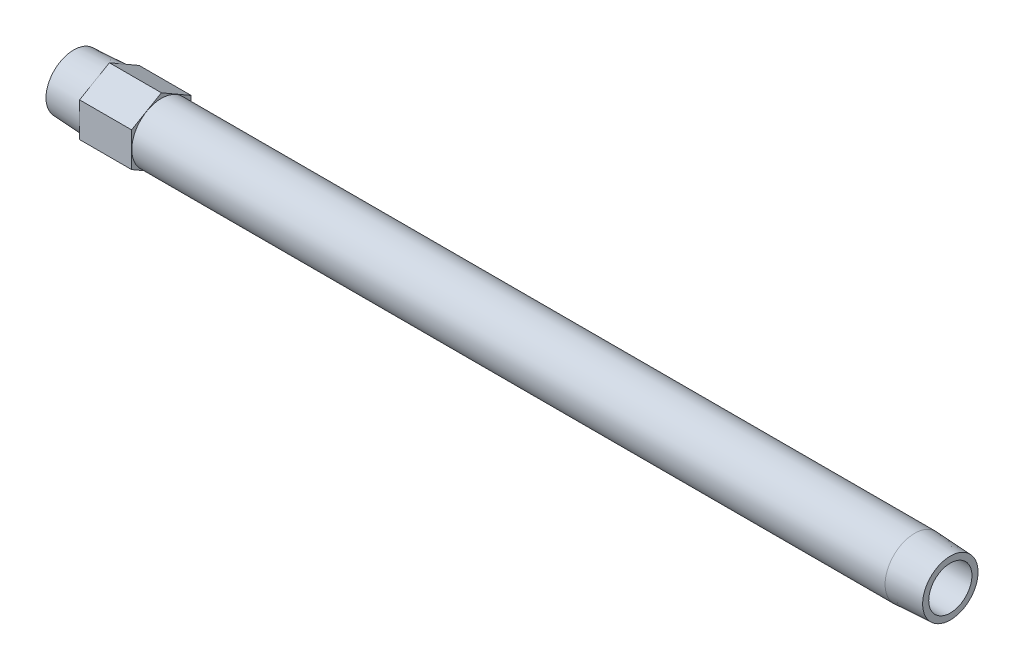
ISO-10303-21;
HEADER;
FILE_DESCRIPTION(('STEP AP214'),'2;1');
FILE_NAME('part.step','',(''),(''),'','','');
FILE_SCHEMA(('AUTOMOTIVE_DESIGN { 1 0 10303 214 1 1 1 1 }'));
ENDSEC;
DATA;
#1=APPLICATION_CONTEXT('core data for automotive mechanical design processes');
#2=APPLICATION_PROTOCOL_DEFINITION('international standard','automotive_design',2000,#1);
#3=PRODUCT_CONTEXT('',#1,'mechanical');
#4=PRODUCT('Part','Part','',(#3));
#5=PRODUCT_RELATED_PRODUCT_CATEGORY('part','',(#4));
#6=PRODUCT_DEFINITION_FORMATION('','',#4);
#7=PRODUCT_DEFINITION_CONTEXT('part definition',#1,'design');
#8=PRODUCT_DEFINITION('design','',#6,#7);
#9=PRODUCT_DEFINITION_SHAPE('','',#8);
#10=(LENGTH_UNIT() NAMED_UNIT(*) SI_UNIT(.MILLI.,.METRE.));
#11=(NAMED_UNIT(*) PLANE_ANGLE_UNIT() SI_UNIT($,.RADIAN.));
#12=(NAMED_UNIT(*) SI_UNIT($,.STERADIAN.) SOLID_ANGLE_UNIT());
#13=UNCERTAINTY_MEASURE_WITH_UNIT(LENGTH_MEASURE(1.E-05),#10,'distance_accuracy_value','');
#14=(GEOMETRIC_REPRESENTATION_CONTEXT(3) GLOBAL_UNCERTAINTY_ASSIGNED_CONTEXT((#13)) GLOBAL_UNIT_ASSIGNED_CONTEXT((#10,
#11,#12)) REPRESENTATION_CONTEXT('',''));
#15=CARTESIAN_POINT('',(0.,0.,0.));
#16=DIRECTION('',(0.,0.,1.));
#17=DIRECTION('',(1.,0.,0.));
#18=AXIS2_PLACEMENT_3D('',#15,#16,#17);
#19=CARTESIAN_POINT('',(0.,0.,-8.03071885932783));
#20=DIRECTION('',(1.,0.,0.));
#21=DIRECTION('',(0.,0.,-1.));
#22=AXIS2_PLACEMENT_3D('',#19,#20,#21);
#23=PLANE('',#22);
#24=CARTESIAN_POINT('',(0.,0.,0.));
#25=DIRECTION('',(-1.,0.,0.));
#26=DIRECTION('',(0.,0.,1.));
#27=AXIS2_PLACEMENT_3D('',#24,#25,#26);
#28=CIRCLE('',#27,8.03071885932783);
#29=CARTESIAN_POINT('',(0.,0.,8.03071885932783));
#30=VERTEX_POINT('',#29);
#31=EDGE_CURVE('E147',#30,#30,#28,.T.);
#32=ORIENTED_EDGE('',*,*,#31,.T.);
#33=EDGE_LOOP('',(#32));
#34=FACE_BOUND('',#33,.T.);
#35=CARTESIAN_POINT('',(0.,0.,0.));
#36=DIRECTION('',(1.,0.,0.));
#37=DIRECTION('',(0.,0.,1.));
#38=AXIS2_PLACEMENT_3D('',#35,#36,#37);
#39=CIRCLE('',#38,6.2611);
#40=CARTESIAN_POINT('',(0.,0.,6.2611));
#41=VERTEX_POINT('',#40);
#42=EDGE_CURVE('E159',#41,#41,#39,.T.);
#43=ORIENTED_EDGE('',*,*,#42,.T.);
#44=EDGE_LOOP('',(#43));
#45=FACE_BOUND('',#44,.T.);
#46=ADVANCED_FACE('F15',(#34,#45),#23,.F.);
#47=CARTESIAN_POINT('',(254.,0.,-8.0307188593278));
#48=DIRECTION('',(-1.,0.,0.));
#49=DIRECTION('',(0.,0.,1.));
#50=AXIS2_PLACEMENT_3D('',#47,#48,#49);
#51=PLANE('',#50);
#52=CARTESIAN_POINT('',(254.,0.,0.));
#53=DIRECTION('',(-1.,0.,0.));
#54=DIRECTION('',(0.,0.,1.));
#55=AXIS2_PLACEMENT_3D('',#52,#53,#54);
#56=CIRCLE('',#55,8.0307188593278);
#57=CARTESIAN_POINT('',(254.,0.,8.0307188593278));
#58=VERTEX_POINT('',#57);
#59=EDGE_CURVE('E150',#58,#58,#56,.T.);
#60=ORIENTED_EDGE('',*,*,#59,.F.);
#61=EDGE_LOOP('',(#60));
#62=FACE_BOUND('',#61,.T.);
#63=CARTESIAN_POINT('',(254.,0.,0.));
#64=DIRECTION('',(-1.,0.,0.));
#65=DIRECTION('',(0.,0.,1.));
#66=AXIS2_PLACEMENT_3D('',#63,#64,#65);
#67=CIRCLE('',#66,6.2611);
#68=CARTESIAN_POINT('',(254.,0.,6.2611));
#69=VERTEX_POINT('',#68);
#70=EDGE_CURVE('E156',#69,#69,#67,.F.);
#71=ORIENTED_EDGE('',*,*,#70,.F.);
#72=EDGE_LOOP('',(#71));
#73=FACE_BOUND('',#72,.T.);
#74=ADVANCED_FACE('F178',(#62,#73),#51,.F.);
#75=CARTESIAN_POINT('',(25.4,-4.9859969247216,-8.636));
#76=DIRECTION('',(1.,0.,0.));
#77=DIRECTION('',(0.,1.,0.));
#78=AXIS2_PLACEMENT_3D('',#75,#76,#77);
#79=PLANE('',#78);
#80=DIRECTION('',(0.,0.5,-0.866025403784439));
#81=VECTOR('',#80,1.);
#82=CARTESIAN_POINT('',(25.4,-9.97199384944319,0.));
#83=LINE('',#82,#81);
#84=CARTESIAN_POINT('',(25.4,-9.97199384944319,0.));
#85=VERTEX_POINT('',#84);
#86=CARTESIAN_POINT('',(25.4,-4.9859969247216,-8.636));
#87=VERTEX_POINT('',#86);
#88=EDGE_CURVE('E103',#85,#87,#83,.T.);
#89=ORIENTED_EDGE('',*,*,#88,.T.);
#90=DIRECTION('',(0.,1.,0.));
#91=VECTOR('',#90,1.);
#92=CARTESIAN_POINT('',(25.4,-4.9859969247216,-8.636));
#93=LINE('',#92,#91);
#94=CARTESIAN_POINT('',(25.4,4.9859969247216,-8.636));
#95=VERTEX_POINT('',#94);
#96=EDGE_CURVE('E83',#87,#95,#93,.T.);
#97=ORIENTED_EDGE('',*,*,#96,.T.);
#98=DIRECTION('',(0.,0.5,0.866025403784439));
#99=VECTOR('',#98,1.);
#100=CARTESIAN_POINT('',(25.4,4.9859969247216,-8.636));
#101=LINE('',#100,#99);
#102=CARTESIAN_POINT('',(25.4,9.97199384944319,0.));
#103=VERTEX_POINT('',#102);
#104=EDGE_CURVE('E102',#95,#103,#101,.T.);
#105=ORIENTED_EDGE('',*,*,#104,.T.);
#106=DIRECTION('',(0.,-0.5,0.866025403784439));
#107=VECTOR('',#106,1.);
#108=CARTESIAN_POINT('',(25.4,9.97199384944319,0.));
#109=LINE('',#108,#107);
#110=CARTESIAN_POINT('',(25.4,4.9859969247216,8.636));
#111=VERTEX_POINT('',#110);
#112=EDGE_CURVE('E105',#103,#111,#109,.T.);
#113=ORIENTED_EDGE('',*,*,#112,.T.);
#114=DIRECTION('',(0.,-1.,0.));
#115=VECTOR('',#114,1.);
#116=CARTESIAN_POINT('',(25.4,4.9859969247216,8.636));
#117=LINE('',#116,#115);
#118=CARTESIAN_POINT('',(25.4,-4.9859969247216,8.636));
#119=VERTEX_POINT('',#118);
#120=EDGE_CURVE('E35',#111,#119,#117,.T.);
#121=ORIENTED_EDGE('',*,*,#120,.T.);
#122=DIRECTION('',(0.,-0.5,-0.866025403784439));
#123=VECTOR('',#122,1.);
#124=CARTESIAN_POINT('',(25.4,-4.9859969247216,8.636));
#125=LINE('',#124,#123);
#126=EDGE_CURVE('E30',#119,#85,#125,.T.);
#127=ORIENTED_EDGE('',*,*,#126,.T.);
#128=EDGE_LOOP('',(#89,#97,#105,#113,#121,#127));
#129=FACE_BOUND('',#128,.T.);
#130=CARTESIAN_POINT('',(25.4,0.,0.));
#131=DIRECTION('',(1.,0.,0.));
#132=DIRECTION('',(0.,1.,0.));
#133=AXIS2_PLACEMENT_3D('',#130,#131,#132);
#134=CIRCLE('',#133,8.5725);
#135=CARTESIAN_POINT('',(25.4,8.5725,0.));
#136=VERTEX_POINT('',#135);
#137=EDGE_CURVE('E89',#136,#136,#134,.F.);
#138=ORIENTED_EDGE('',*,*,#137,.T.);
#139=EDGE_LOOP('',(#138));
#140=FACE_BOUND('',#139,.T.);
#141=ADVANCED_FACE('F124',(#129,#140),#79,.T.);
#142=CARTESIAN_POINT('',(10.3378,-4.9859969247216,-8.636));
#143=DIRECTION('',(1.,0.,0.));
#144=DIRECTION('',(0.,1.,0.));
#145=AXIS2_PLACEMENT_3D('',#142,#143,#144);
#146=PLANE('',#145);
#147=DIRECTION('',(0.,0.5,-0.866025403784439));
#148=VECTOR('',#147,1.);
#149=CARTESIAN_POINT('',(10.3378,-9.97199384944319,0.));
#150=LINE('',#149,#148);
#151=CARTESIAN_POINT('',(10.3378,-9.97199384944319,0.));
#152=VERTEX_POINT('',#151);
#153=CARTESIAN_POINT('',(10.3378,-4.9859969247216,-8.636));
#154=VERTEX_POINT('',#153);
#155=EDGE_CURVE('E73',#152,#154,#150,.T.);
#156=ORIENTED_EDGE('',*,*,#155,.F.);
#157=DIRECTION('',(0.,-0.5,-0.866025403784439));
#158=VECTOR('',#157,1.);
#159=CARTESIAN_POINT('',(10.3378,-4.9859969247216,8.636));
#160=LINE('',#159,#158);
#161=CARTESIAN_POINT('',(10.3378,-4.9859969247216,8.636));
#162=VERTEX_POINT('',#161);
#163=EDGE_CURVE('E99',#162,#152,#160,.T.);
#164=ORIENTED_EDGE('',*,*,#163,.F.);
#165=DIRECTION('',(0.,-1.,0.));
#166=VECTOR('',#165,1.);
#167=CARTESIAN_POINT('',(10.3378,4.9859969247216,8.636));
#168=LINE('',#167,#166);
#169=CARTESIAN_POINT('',(10.3378,4.9859969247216,8.636));
#170=VERTEX_POINT('',#169);
#171=EDGE_CURVE('E133',#170,#162,#168,.T.);
#172=ORIENTED_EDGE('',*,*,#171,.F.);
#173=DIRECTION('',(0.,-0.5,0.866025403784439));
#174=VECTOR('',#173,1.);
#175=CARTESIAN_POINT('',(10.3378,9.97199384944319,0.));
#176=LINE('',#175,#174);
#177=CARTESIAN_POINT('',(10.3378,9.97199384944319,0.));
#178=VERTEX_POINT('',#177);
#179=EDGE_CURVE('E129',#178,#170,#176,.T.);
#180=ORIENTED_EDGE('',*,*,#179,.F.);
#181=DIRECTION('',(0.,0.5,0.866025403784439));
#182=VECTOR('',#181,1.);
#183=CARTESIAN_POINT('',(10.3378,4.9859969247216,-8.636));
#184=LINE('',#183,#182);
#185=CARTESIAN_POINT('',(10.3378,4.9859969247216,-8.636));
#186=VERTEX_POINT('',#185);
#187=EDGE_CURVE('E75',#186,#178,#184,.T.);
#188=ORIENTED_EDGE('',*,*,#187,.F.);
#189=DIRECTION('',(0.,1.,0.));
#190=VECTOR('',#189,1.);
#191=CARTESIAN_POINT('',(10.3378,-4.9859969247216,-8.636));
#192=LINE('',#191,#190);
#193=EDGE_CURVE('E68',#154,#186,#192,.T.);
#194=ORIENTED_EDGE('',*,*,#193,.F.);
#195=EDGE_LOOP('',(#156,#164,#172,#180,#188,#194));
#196=FACE_BOUND('',#195,.T.);
#197=CARTESIAN_POINT('',(10.3378,0.,0.));
#198=DIRECTION('',(-1.,0.,0.));
#199=DIRECTION('',(0.,0.,1.));
#200=AXIS2_PLACEMENT_3D('',#197,#198,#199);
#201=CIRCLE('',#200,8.5725);
#202=CARTESIAN_POINT('',(10.3378,0.,8.5725));
#203=VERTEX_POINT('',#202);
#204=EDGE_CURVE('E95',#203,#203,#201,.T.);
#205=ORIENTED_EDGE('',*,*,#204,.F.);
#206=EDGE_LOOP('',(#205));
#207=FACE_BOUND('',#206,.T.);
#208=ADVANCED_FACE('F69',(#196,#207),#146,.F.);
#209=CARTESIAN_POINT('',(25.4,-9.97199384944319,0.));
#210=DIRECTION('',(0.,0.866025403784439,0.5));
#211=DIRECTION('',(0.,-0.5,0.866025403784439));
#212=AXIS2_PLACEMENT_3D('',#209,#210,#211);
#213=PLANE('',#212);
#214=ORIENTED_EDGE('',*,*,#155,.T.);
#215=DIRECTION('',(-1.,0.,0.));
#216=VECTOR('',#215,1.);
#217=CARTESIAN_POINT('',(25.4,-4.9859969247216,-8.636));
#218=LINE('',#217,#216);
#219=EDGE_CURVE('E10',#87,#154,#218,.T.);
#220=ORIENTED_EDGE('',*,*,#219,.F.);
#221=ORIENTED_EDGE('',*,*,#88,.F.);
#222=DIRECTION('',(-1.,0.,0.));
#223=VECTOR('',#222,1.);
#224=CARTESIAN_POINT('',(25.4,-9.97199384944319,0.));
#225=LINE('',#224,#223);
#226=EDGE_CURVE('E87',#85,#152,#225,.T.);
#227=ORIENTED_EDGE('',*,*,#226,.T.);
#228=EDGE_LOOP('',(#214,#220,#221,#227));
#229=FACE_BOUND('',#228,.T.);
#230=ADVANCED_FACE('F17',(#229),#213,.F.);
#231=CARTESIAN_POINT('',(25.4,-4.9859969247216,-8.636));
#232=DIRECTION('',(0.,0.,1.));
#233=DIRECTION('',(1.,0.,0.));
#234=AXIS2_PLACEMENT_3D('',#231,#232,#233);
#235=PLANE('',#234);
#236=ORIENTED_EDGE('',*,*,#193,.T.);
#237=DIRECTION('',(-1.,0.,0.));
#238=VECTOR('',#237,1.);
#239=CARTESIAN_POINT('',(25.4,4.9859969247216,-8.636));
#240=LINE('',#239,#238);
#241=EDGE_CURVE('E23',#95,#186,#240,.T.);
#242=ORIENTED_EDGE('',*,*,#241,.F.);
#243=ORIENTED_EDGE('',*,*,#96,.F.);
#244=ORIENTED_EDGE('',*,*,#219,.T.);
#245=EDGE_LOOP('',(#236,#242,#243,#244));
#246=FACE_BOUND('',#245,.T.);
#247=ADVANCED_FACE('F82',(#246),#235,.F.);
#248=CARTESIAN_POINT('',(25.4,4.9859969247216,-8.636));
#249=DIRECTION('',(0.,-0.866025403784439,0.5));
#250=DIRECTION('',(0.,-0.5,-0.866025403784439));
#251=AXIS2_PLACEMENT_3D('',#248,#249,#250);
#252=PLANE('',#251);
#253=ORIENTED_EDGE('',*,*,#187,.T.);
#254=DIRECTION('',(-1.,0.,0.));
#255=VECTOR('',#254,1.);
#256=CARTESIAN_POINT('',(25.4,9.97199384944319,0.));
#257=LINE('',#256,#255);
#258=EDGE_CURVE('E117',#103,#178,#257,.T.);
#259=ORIENTED_EDGE('',*,*,#258,.F.);
#260=ORIENTED_EDGE('',*,*,#104,.F.);
#261=ORIENTED_EDGE('',*,*,#241,.T.);
#262=EDGE_LOOP('',(#253,#259,#260,#261));
#263=FACE_BOUND('',#262,.T.);
#264=ADVANCED_FACE('F121',(#263),#252,.F.);
#265=CARTESIAN_POINT('',(25.4,9.97199384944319,0.));
#266=DIRECTION('',(0.,-0.866025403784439,-0.5));
#267=DIRECTION('',(0.,0.5,-0.866025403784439));
#268=AXIS2_PLACEMENT_3D('',#265,#266,#267);
#269=PLANE('',#268);
#270=ORIENTED_EDGE('',*,*,#179,.T.);
#271=DIRECTION('',(-1.,0.,0.));
#272=VECTOR('',#271,1.);
#273=CARTESIAN_POINT('',(25.4,4.9859969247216,8.636));
#274=LINE('',#273,#272);
#275=EDGE_CURVE('E114',#111,#170,#274,.T.);
#276=ORIENTED_EDGE('',*,*,#275,.F.);
#277=ORIENTED_EDGE('',*,*,#112,.F.);
#278=ORIENTED_EDGE('',*,*,#258,.T.);
#279=EDGE_LOOP('',(#270,#276,#277,#278));
#280=FACE_BOUND('',#279,.T.);
#281=ADVANCED_FACE('F128',(#280),#269,.F.);
#282=CARTESIAN_POINT('',(25.4,4.9859969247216,8.636));
#283=DIRECTION('',(0.,0.,-1.));
#284=DIRECTION('',(-1.,0.,0.));
#285=AXIS2_PLACEMENT_3D('',#282,#283,#284);
#286=PLANE('',#285);
#287=ORIENTED_EDGE('',*,*,#171,.T.);
#288=DIRECTION('',(-1.,0.,0.));
#289=VECTOR('',#288,1.);
#290=CARTESIAN_POINT('',(25.4,-4.9859969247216,8.636));
#291=LINE('',#290,#289);
#292=EDGE_CURVE('E111',#119,#162,#291,.T.);
#293=ORIENTED_EDGE('',*,*,#292,.F.);
#294=ORIENTED_EDGE('',*,*,#120,.F.);
#295=ORIENTED_EDGE('',*,*,#275,.T.);
#296=EDGE_LOOP('',(#287,#293,#294,#295));
#297=FACE_BOUND('',#296,.T.);
#298=ADVANCED_FACE('F132',(#297),#286,.F.);
#299=CARTESIAN_POINT('',(25.4,-4.9859969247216,8.636));
#300=DIRECTION('',(0.,0.866025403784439,-0.5));
#301=DIRECTION('',(0.,0.5,0.866025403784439));
#302=AXIS2_PLACEMENT_3D('',#299,#300,#301);
#303=PLANE('',#302);
#304=ORIENTED_EDGE('',*,*,#163,.T.);
#305=ORIENTED_EDGE('',*,*,#226,.F.);
#306=ORIENTED_EDGE('',*,*,#126,.F.);
#307=ORIENTED_EDGE('',*,*,#292,.T.);
#308=EDGE_LOOP('',(#304,#305,#306,#307));
#309=FACE_BOUND('',#308,.T.);
#310=ADVANCED_FACE('F135',(#309),#303,.F.);
#311=CARTESIAN_POINT('',(10.3378,0.,0.));
#312=DIRECTION('',(1.,0.,0.));
#313=DIRECTION('',(0.,0.,-1.));
#314=AXIS2_PLACEMENT_3D('',#311,#312,#313);
#315=CONICAL_SURFACE('',#314,8.5725,0.0523598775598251);
#316=ORIENTED_EDGE('',*,*,#31,.F.);
#317=EDGE_LOOP('',(#316));
#318=FACE_BOUND('',#317,.T.);
#319=ORIENTED_EDGE('',*,*,#204,.T.);
#320=EDGE_LOOP('',(#319));
#321=FACE_BOUND('',#320,.T.);
#322=ADVANCED_FACE('F187',(#318,#321),#315,.T.);
#323=CARTESIAN_POINT('',(-60.,0.,0.));
#324=DIRECTION('',(-1.,0.,0.));
#325=DIRECTION('',(0.,0.,1.));
#326=AXIS2_PLACEMENT_3D('',#323,#324,#325);
#327=CYLINDRICAL_SURFACE('',#326,8.5725);
#328=ORIENTED_EDGE('',*,*,#137,.F.);
#329=EDGE_LOOP('',(#328));
#330=FACE_BOUND('',#329,.T.);
#331=CARTESIAN_POINT('',(243.6622,0.,0.));
#332=DIRECTION('',(-1.,0.,0.));
#333=DIRECTION('',(0.,0.,1.));
#334=AXIS2_PLACEMENT_3D('',#331,#332,#333);
#335=CIRCLE('',#334,8.5725);
#336=CARTESIAN_POINT('',(243.6622,0.,8.5725));
#337=VERTEX_POINT('',#336);
#338=EDGE_CURVE('E153',#337,#337,#335,.T.);
#339=ORIENTED_EDGE('',*,*,#338,.T.);
#340=EDGE_LOOP('',(#339));
#341=FACE_BOUND('',#340,.T.);
#342=ADVANCED_FACE('F174',(#330,#341),#327,.T.);
#343=CARTESIAN_POINT('',(254.,0.,0.));
#344=DIRECTION('',(-1.,0.,0.));
#345=DIRECTION('',(0.,0.,1.));
#346=AXIS2_PLACEMENT_3D('',#343,#344,#345);
#347=CONICAL_SURFACE('',#346,8.0307188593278,0.0523598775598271);
#348=ORIENTED_EDGE('',*,*,#338,.F.);
#349=EDGE_LOOP('',(#348));
#350=FACE_BOUND('',#349,.T.);
#351=ORIENTED_EDGE('',*,*,#59,.T.);
#352=EDGE_LOOP('',(#351));
#353=FACE_BOUND('',#352,.T.);
#354=ADVANCED_FACE('F167',(#350,#353),#347,.T.);
#355=CARTESIAN_POINT('',(255.366569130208,0.,0.));
#356=DIRECTION('',(-1.,0.,0.));
#357=DIRECTION('',(0.,0.,1.));
#358=AXIS2_PLACEMENT_3D('',#355,#356,#357);
#359=CYLINDRICAL_SURFACE('',#358,6.2611);
#360=ORIENTED_EDGE('',*,*,#70,.T.);
#361=EDGE_LOOP('',(#360));
#362=FACE_BOUND('',#361,.T.);
#363=ORIENTED_EDGE('',*,*,#42,.F.);
#364=EDGE_LOOP('',(#363));
#365=FACE_BOUND('',#364,.T.);
#366=ADVANCED_FACE('F165',(#362,#365),#359,.F.);
#367=CLOSED_SHELL('',(#46,#74,#141,#208,#230,#247,#264,#281,#298,#310,#322,#342,#354,#366));
#368=MANIFOLD_SOLID_BREP('B1',#367);
#369=ADVANCED_BREP_SHAPE_REPRESENTATION('',(#18,#368),#14);
#370=SHAPE_DEFINITION_REPRESENTATION(#9,#369);
ENDSEC;
END-ISO-10303-21;
